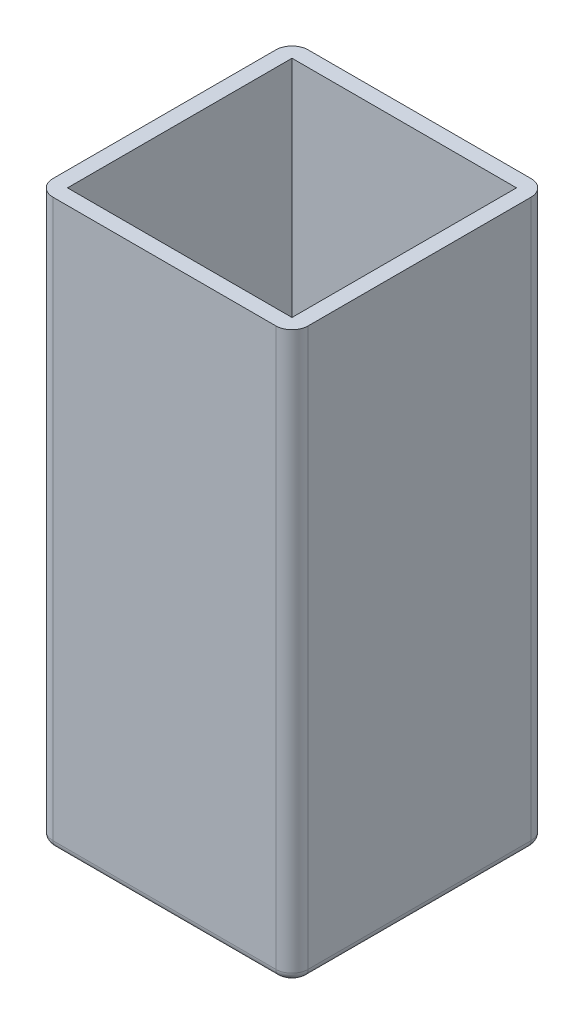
from build123d import *

# Parameters (mm, degrees)
SKETCH1_W           = 15.8
SKETCH1_H           = 15.8
SKETCH1_W_2         = 13.9
SKETCH1_H_2         = 13.9
BOSS_EXTRUDE1_DEPTH = 34
SKETCH2_W           = 15.8
SKETCH2_H           = 15.8
BOSS_EXTRUDE2_DEPTH = 1
FILLET1_R           = 1
FILLET2_R           = 0.5


with BuildPart() as part:
    # Sketch1 → Boss-Extrude1 (new body)
    with BuildSketch(Plane(origin=(0, 0, 0), x_dir=(1, 0, 0), z_dir=(0, 1, 0))):
        Rectangle(SKETCH1_W, SKETCH1_H)
        Rectangle(SKETCH1_W_2, SKETCH1_H_2, mode=Mode.SUBTRACT)
    extrude(amount=BOSS_EXTRUDE1_DEPTH)

    # Sketch2 → Boss-Extrude2 (add)
    with BuildSketch(Plane.XZ):
        Rectangle(SKETCH2_W, SKETCH2_H)
    extrude(amount=BOSS_EXTRUDE2_DEPTH)

    # Fillet1
    fillet1_edges = [part.edges().sort_by_distance(p)[0] for p in [
        (7.9, 16.5, 7.9),
        (-7.9, 16.5, 7.9),
        (-7.9, 16.5, -7.9),
        (7.9, 16.5, -7.9),
    ]]
    fillet(fillet1_edges, radius=FILLET1_R)

    # Fillet2
    fillet2_edges = [part.edges().sort_by_distance(p)[0] for p in [
        (-7.9, -1, 0),
        (0, -1, -7.9),
        (7.9, -1, 0),
        (0, -1, 7.9),
        (7.607106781, -1, 7.607106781),
        (-7.607106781, -1, 7.607106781),
        (7.607106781, -1, -7.607106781),
        (-7.607106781, -1, -7.607106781),
    ]]
    fillet(fillet2_edges, radius=FILLET2_R)


solid = part.part
